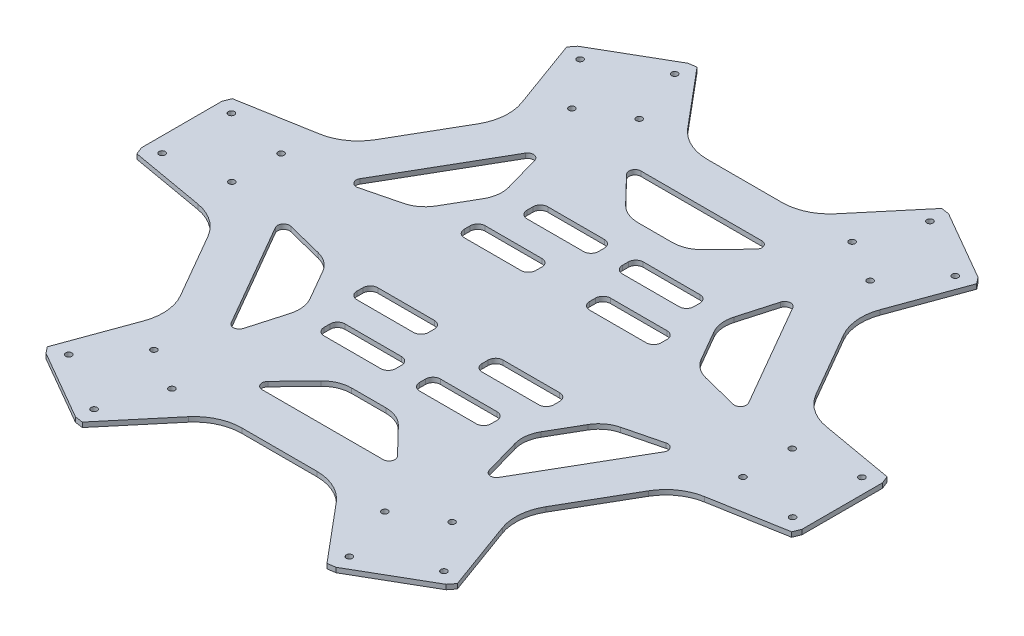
from build123d import *

# Parameters (mm, degrees)
BASE_PLATE_DEPTH                  = 1.6
FILLET3_R                         = 16
M2_5X0_45_TAPPED_HOLE1_AT_2_COUNT = 2
M2_5X0_45_TAPPED_HOLE1_AT_2_PITCH = 20.278621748
M2_5X0_45_TAPPED_HOLE1_AT_3_COUNT = 2
M2_5X0_45_TAPPED_HOLE1_AT_3_PITCH = 28.178404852
M2_5X0_45_TAPPED_HOLE1_AT_4_COUNT = 2
M2_5X0_45_TAPPED_HOLE1_AT_4_PITCH = 23.2
CIRPATTERN1_COUNT                 = 6
CUT_EXTRUDE1_REACH                = 153.283
FILLET4_R                         = 2
FILLET5_R                         = 10
CIRPATTERN2_COUNT                 = 6
FILLET4_OF_CIRPATTERN2_R          = 2
FILLET5_OF_CIRPATTERN2_R          = 10
CUT_EXTRUDE2_REACH                = 153.283
SKETCH8_W                         = 24
SKETCH8_H                         = 7
FILLET6_R                         = 2.5


with BuildPart() as part:
    # Sketch2 → Base plate (new body)
    with BuildSketch(Plane(origin=(0, 0, 0), x_dir=(1, 0, 0), z_dir=(0, 1, 0))):
        Polygon((-67.549981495, -39), (-77.558311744, -21.665063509), (-109.75, -16), (-110.75, -13.5), (-110.75, 13.5), (-109.75, 16), (-77.558311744, 21.665063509), (-67.549981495, 39), (-57.541651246, 56.334936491), (-68.731406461, 87.046288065), (-67.066342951, 89.162313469), (-43.683657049, 102.662313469), (-41.018593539, 103.046288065), (-20.016660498, 78), (0, 78), (20.016660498, 78), (41.018593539, 103.046288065), (43.683657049, 102.662313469), (67.066342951, 89.162313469), (68.731406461, 87.046288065), (57.541651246, 56.334936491), (67.549981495, 39), (77.558311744, 21.665063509), (109.75, 16), (110.75, 13.5), (110.75, -13.5), (109.75, -16), (77.558311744, -21.665063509), (67.549981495, -39), (57.541651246, -56.334936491), (68.731406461, -87.046288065), (67.066342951, -89.162313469), (43.683657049, -102.662313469), (41.018593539, -103.046288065), (20.016660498, -78), (0, -78), (-20.016660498, -78), (-41.018593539, -103.046288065), (-43.683657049, -102.662313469), (-67.066342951, -89.162313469), (-68.731406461, -87.046288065), (-57.541651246, -56.334936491), align=None)
    extrude(amount=BASE_PLATE_DEPTH)

    # Fillet3
    fillet3_edges = [part.edges().sort_by_distance(p)[0] for p in [
        (-77.558311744, 0.8, 21.665063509),
        (-77.558311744, 0.8, -21.665063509),
        (-57.541651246, 0.8, -56.334936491),
        (-20.016660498, 0.8, -78),
        (20.016660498, 0.8, -78),
        (57.541651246, 0.8, -56.334936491),
        (77.558311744, 0.8, -21.665063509),
        (77.558311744, 0.8, 21.665063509),
        (57.541651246, 0.8, 56.334936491),
        (20.016660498, 0.8, 78),
        (-20.016660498, 0.8, 78),
        (-57.541651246, 0.8, 56.334936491),
    ]]
    fillet(fillet3_edges, radius=FILLET3_R)

    # Sketch5 → M2.5x0.45 Tapped Hole1 (revolve, cut)
    with BuildSketch(Plane(origin=(-62.885894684, 1.6, -85.721564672), x_dir=(0, 0, 1), z_dir=(1, 0, 0))):
        Polygon((0, 0), (0, 6.965882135), (1.025, 6.35), (1.025, 0), align=None)
    m2_5x0_45_tapped_hole1 = revolve(axis=Axis((-62.885894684, 7.95, -85.721564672), (0, -1, 0)), mode=Mode.SUBTRACT)

    # M2.5x0.45 Tapped Hole1 at 2: M2.5x0.45 Tapped Hole1 ×2
    with Locations(*[Vector(0.6361963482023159, 0, 0.7715271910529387) * (i * M2_5X0_45_TAPPED_HOLE1_AT_2_PITCH) for i in range(1, M2_5X0_45_TAPPED_HOLE1_AT_2_COUNT)]):
        add(m2_5x0_45_tapped_hole1, mode=Mode.SUBTRACT)

    # M2.5x0.45 Tapped Hole1 at 3: M2.5x0.45 Tapped Hole1 ×2
    with Locations(*[Vector(0.9649447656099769, 0, 0.262453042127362) * (i * M2_5X0_45_TAPPED_HOLE1_AT_3_PITCH) for i in range(1, M2_5X0_45_TAPPED_HOLE1_AT_3_COUNT)]):
        add(m2_5x0_45_tapped_hole1, mode=Mode.SUBTRACT)

    # M2.5x0.45 Tapped Hole1 at 4: M2.5x0.45 Tapped Hole1 ×2
    with Locations(*[Vector(0.8660254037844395, 0, -0.4999999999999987) * (i * M2_5X0_45_TAPPED_HOLE1_AT_4_PITCH) for i in range(1, M2_5X0_45_TAPPED_HOLE1_AT_4_COUNT)]):
        add(m2_5x0_45_tapped_hole1, mode=Mode.SUBTRACT)

    # CirPattern1: M2.5x0.45 Tapped Hole1 ×6 about axis
    cirpattern1_axis = Axis((0, 0, 0), (0, 1, 0))
    for i in range(1, CIRPATTERN1_COUNT):
        add(m2_5x0_45_tapped_hole1.rotate(cirpattern1_axis, i * 360 / CIRPATTERN1_COUNT), mode=Mode.SUBTRACT)

    # CirPattern1 copy 1 sketch → CirPattern1 copy 1 (revolve, cut)
    with BuildSketch(Plane(origin=(-85.68, 1.6, 8.25), x_dir=(0.8660254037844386, 0, 0.5000000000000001), z_dir=(0.5000000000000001, 0, -0.8660254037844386))):
        Polygon((0, 0), (0, 6.965882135), (1.025, 6.35), (1.025, 0), align=None)
    revolve(axis=Axis((-85.68, 7.95, 8.25), (0, -1, 0)), mode=Mode.SUBTRACT)

    # CirPattern1 copy 2 sketch → CirPattern1 copy 2 (revolve, cut)
    with BuildSketch(Plane(origin=(-35.695290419, 1.6, 78.326056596), x_dir=(0.8660254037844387, 0, -0.4999999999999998), z_dir=(-0.4999999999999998, 0, -0.8660254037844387))):
        Polygon((0, 0), (0, 6.965882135), (1.025, 6.35), (1.025, 0), align=None)
    revolve(axis=Axis((-35.695290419, 7.95, 78.326056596), (0, -1, 0)), mode=Mode.SUBTRACT)

    # CirPattern1 copy 3 sketch → CirPattern1 copy 3 (revolve, cut)
    with BuildSketch(Plane(origin=(49.984709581, 1.6, 70.076056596), x_dir=(0, 0, -1), z_dir=(-1, 0, 0))):
        Polygon((0, 0), (0, 6.965882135), (1.025, 6.35), (1.025, 0), align=None)
    revolve(axis=Axis((49.984709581, 7.95, 70.076056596), (0, -1, 0)), mode=Mode.SUBTRACT)

    # CirPattern1 copy 4 sketch → CirPattern1 copy 4 (revolve, cut)
    with BuildSketch(Plane(origin=(85.68, 1.6, -8.25), x_dir=(-0.8660254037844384, 0, -0.5000000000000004), z_dir=(-0.5000000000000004, 0, 0.8660254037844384))):
        Polygon((0, 0), (0, 6.965882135), (1.025, 6.35), (1.025, 0), align=None)
    revolve(axis=Axis((85.68, 7.95, -8.25), (0, -1, 0)), mode=Mode.SUBTRACT)

    # CirPattern1 copy 5 sketch → CirPattern1 copy 5 (revolve, cut)
    with BuildSketch(Plane(origin=(35.695290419, 1.6, -78.326056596), x_dir=(-0.8660254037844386, 0, 0.5000000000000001), z_dir=(0.5000000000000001, 0, 0.8660254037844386))):
        Polygon((0, 0), (0, 6.965882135), (1.025, 6.35), (1.025, 0), align=None)
    revolve(axis=Axis((35.695290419, 7.95, -78.326056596), (0, -1, 0)), mode=Mode.SUBTRACT)

    # CirPattern1 copy 6 sketch → CirPattern1 copy 6 (revolve, cut)
    with BuildSketch(Plane(origin=(-85.68, 1.6, -8.25), x_dir=(0.8660254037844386, 0, 0.5000000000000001), z_dir=(0.5000000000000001, 0, -0.8660254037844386))):
        Polygon((0, 0), (0, 6.965882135), (1.025, 6.35), (1.025, 0), align=None)
    revolve(axis=Axis((-85.68, 7.95, -8.25), (0, -1, 0)), mode=Mode.SUBTRACT)

    # CirPattern1 copy 7 sketch → CirPattern1 copy 7 (revolve, cut)
    with BuildSketch(Plane(origin=(-49.984709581, 1.6, 70.076056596), x_dir=(0.8660254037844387, 0, -0.4999999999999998), z_dir=(-0.4999999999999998, 0, -0.8660254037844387))):
        Polygon((0, 0), (0, 6.965882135), (1.025, 6.35), (1.025, 0), align=None)
    revolve(axis=Axis((-49.984709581, 7.95, 70.076056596), (0, -1, 0)), mode=Mode.SUBTRACT)

    # CirPattern1 copy 8 sketch → CirPattern1 copy 8 (revolve, cut)
    with BuildSketch(Plane(origin=(35.695290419, 1.6, 78.326056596), x_dir=(0, 0, -1), z_dir=(-1, 0, 0))):
        Polygon((0, 0), (0, 6.965882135), (1.025, 6.35), (1.025, 0), align=None)
    revolve(axis=Axis((35.695290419, 7.95, 78.326056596), (0, -1, 0)), mode=Mode.SUBTRACT)

    # CirPattern1 copy 9 sketch → CirPattern1 copy 9 (revolve, cut)
    with BuildSketch(Plane(origin=(85.68, 1.6, 8.25), x_dir=(-0.8660254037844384, 0, -0.5000000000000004), z_dir=(-0.5000000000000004, 0, 0.8660254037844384))):
        Polygon((0, 0), (0, 6.965882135), (1.025, 6.35), (1.025, 0), align=None)
    revolve(axis=Axis((85.68, 7.95, 8.25), (0, -1, 0)), mode=Mode.SUBTRACT)

    # CirPattern1 copy 10 sketch → CirPattern1 copy 10 (revolve, cut)
    with BuildSketch(Plane(origin=(49.984709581, 1.6, -70.076056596), x_dir=(-0.8660254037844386, 0, 0.5000000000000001), z_dir=(0.5000000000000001, 0, 0.8660254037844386))):
        Polygon((0, 0), (0, 6.965882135), (1.025, 6.35), (1.025, 0), align=None)
    revolve(axis=Axis((49.984709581, 7.95, -70.076056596), (0, -1, 0)), mode=Mode.SUBTRACT)

    # CirPattern1 copy 11 sketch → CirPattern1 copy 11 (revolve, cut)
    with BuildSketch(Plane(origin=(-105.68, 1.6, -11.6), x_dir=(0.8660254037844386, 0, 0.5000000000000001), z_dir=(0.5000000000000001, 0, -0.8660254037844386))):
        Polygon((0, 0), (0, 6.965882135), (1.025, 6.35), (1.025, 0), align=None)
    revolve(axis=Axis((-105.68, 7.95, -11.6), (0, -1, 0)), mode=Mode.SUBTRACT)

    # CirPattern1 copy 12 sketch → CirPattern1 copy 12 (revolve, cut)
    with BuildSketch(Plane(origin=(-62.885894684, 1.6, 85.721564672), x_dir=(0.8660254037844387, 0, -0.4999999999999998), z_dir=(-0.4999999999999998, 0, -0.8660254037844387))):
        Polygon((0, 0), (0, 6.965882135), (1.025, 6.35), (1.025, 0), align=None)
    revolve(axis=Axis((-62.885894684, 7.95, 85.721564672), (0, -1, 0)), mode=Mode.SUBTRACT)

    # CirPattern1 copy 13 sketch → CirPattern1 copy 13 (revolve, cut)
    with BuildSketch(Plane(origin=(42.794105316, 1.6, 97.321564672), x_dir=(0, 0, -1), z_dir=(-1, 0, 0))):
        Polygon((0, 0), (0, 6.965882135), (1.025, 6.35), (1.025, 0), align=None)
    revolve(axis=Axis((42.794105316, 7.95, 97.321564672), (0, -1, 0)), mode=Mode.SUBTRACT)

    # CirPattern1 copy 14 sketch → CirPattern1 copy 14 (revolve, cut)
    with BuildSketch(Plane(origin=(105.68, 1.6, 11.6), x_dir=(-0.8660254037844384, 0, -0.5000000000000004), z_dir=(-0.5000000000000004, 0, 0.8660254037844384))):
        Polygon((0, 0), (0, 6.965882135), (1.025, 6.35), (1.025, 0), align=None)
    revolve(axis=Axis((105.68, 7.95, 11.6), (0, -1, 0)), mode=Mode.SUBTRACT)

    # CirPattern1 copy 15 sketch → CirPattern1 copy 15 (revolve, cut)
    with BuildSketch(Plane(origin=(62.885894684, 1.6, -85.721564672), x_dir=(-0.8660254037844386, 0, 0.5000000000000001), z_dir=(0.5000000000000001, 0, 0.8660254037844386))):
        Polygon((0, 0), (0, 6.965882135), (1.025, 6.35), (1.025, 0), align=None)
    revolve(axis=Axis((62.885894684, 7.95, -85.721564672), (0, -1, 0)), mode=Mode.SUBTRACT)

    # Sketch7 → Cut-Extrude1 (cut, up to next)
    with BuildSketch(Plane(origin=(0, 1.6, 0), x_dir=(1, 0, 0), z_dir=(0, 1, 0)), mode=Mode.PRIVATE) as cut_extrude1_sk1:
        Polygon((25, 63.5), (-25, 63.5), (-10, 48), (10, 48), align=None)
    cut_extrude1_tool1 = extrude(cut_extrude1_sk1.sketch, amount=-CUT_EXTRUDE1_REACH, mode=Mode.PRIVATE) & part.part
    cut_extrude1 = cut_extrude1_tool1.solids().sort_by_distance((0, 1.6, -56.857143))[0]
    add(cut_extrude1, mode=Mode.SUBTRACT)

    # Fillet4
    fillet4_edges = [part.edges().sort_by_distance(p)[0] for p in [
        (25, 0.8, -63.5),
        (-25, 0.8, -63.5),
    ]]
    fillet(fillet4_edges, radius=FILLET4_R)

    # Fillet5
    fillet5_edges = [part.edges().sort_by_distance(p)[0] for p in [
        (10, 0.8, -48),
        (-10, 0.8, -48),
    ]]
    fillet(fillet5_edges, radius=FILLET5_R)

    # CirPattern2: Cut-Extrude1 ×6 about axis
    cirpattern2_axis = Axis((0, 0, 0), (0, 1, 0))
    for i in range(1, CIRPATTERN2_COUNT):
        add(cut_extrude1.rotate(cirpattern2_axis, i * 360 / CIRPATTERN2_COUNT), mode=Mode.SUBTRACT)

    # Fillet4 of CirPattern2
    fillet4_of_cirpattern2_edges = [part.edges().sort_by_distance(p)[0] for p in [
        (-42.49261314, 0.8, -53.400635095),
        (-67.49261314, 0.8, -10.099364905),
        (-67.49261314, 0.8, 10.099364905),
        (-42.49261314, 0.8, 53.400635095),
        (-25, 0.8, 63.5),
        (25, 0.8, 63.5),
        (42.49261314, 0.8, 53.400635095),
        (67.49261314, 0.8, 10.099364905),
        (67.49261314, 0.8, -10.099364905),
        (42.49261314, 0.8, -53.400635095),
    ]]
    fillet(fillet4_of_cirpattern2_edges, radius=FILLET4_OF_CIRPATTERN2_R)

    # Fillet5 of CirPattern2
    fillet5_of_cirpattern2_edges = [part.edges().sort_by_distance(p)[0] for p in [
        (-36.569219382, 0.8, -32.660254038),
        (-46.569219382, 0.8, -15.339745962),
        (-46.569219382, 0.8, 15.339745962),
        (-36.569219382, 0.8, 32.660254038),
        (-10, 0.8, 48),
        (10, 0.8, 48),
        (36.569219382, 0.8, 32.660254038),
        (46.569219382, 0.8, 15.339745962),
        (46.569219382, 0.8, -15.339745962),
        (36.569219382, 0.8, -32.660254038),
    ]]
    fillet(fillet5_of_cirpattern2_edges, radius=FILLET5_OF_CIRPATTERN2_R)

    # Sketch8 → Cut-Extrude2 (cut, up to next)
    with BuildSketch(Plane(origin=(0, 1.6, 0), x_dir=(1, 0, 0), z_dir=(0, 1, 0)), mode=Mode.PRIVATE) as cut_extrude2_sk1:
        with Locations((-16, 34)):
            Rectangle(SKETCH8_W, SKETCH8_H)
    cut_extrude2_tool1 = extrude(cut_extrude2_sk1.sketch, amount=-CUT_EXTRUDE2_REACH, mode=Mode.PRIVATE) & part.part
    # Sketch8 → Cut-Extrude2 (cut, up to next)
    with BuildSketch(Plane(origin=(0, 1.6, 0), x_dir=(1, 0, 0), z_dir=(0, 1, 0)), mode=Mode.PRIVATE) as cut_extrude2_sk2:
        with Locations((-21, 18)):
            Rectangle(SKETCH8_W, SKETCH8_H)
    cut_extrude2_tool2 = extrude(cut_extrude2_sk2.sketch, amount=-CUT_EXTRUDE2_REACH, mode=Mode.PRIVATE) & part.part
    # Sketch8 → Cut-Extrude2 (cut, up to next)
    with BuildSketch(Plane(origin=(0, 1.6, 0), x_dir=(1, 0, 0), z_dir=(0, 1, 0)), mode=Mode.PRIVATE) as cut_extrude2_sk3:
        with Locations((16, 34)):
            Rectangle(SKETCH8_W, SKETCH8_H)
    cut_extrude2_tool3 = extrude(cut_extrude2_sk3.sketch, amount=-CUT_EXTRUDE2_REACH, mode=Mode.PRIVATE) & part.part
    # Sketch8 → Cut-Extrude2 (cut, up to next)
    with BuildSketch(Plane(origin=(0, 1.6, 0), x_dir=(1, 0, 0), z_dir=(0, 1, 0)), mode=Mode.PRIVATE) as cut_extrude2_sk4:
        with Locations((21, 18)):
            Rectangle(SKETCH8_W, SKETCH8_H)
    cut_extrude2_tool4 = extrude(cut_extrude2_sk4.sketch, amount=-CUT_EXTRUDE2_REACH, mode=Mode.PRIVATE) & part.part
    # Sketch8 → Cut-Extrude2 (cut, up to next)
    with BuildSketch(Plane(origin=(0, 1.6, 0), x_dir=(1, 0, 0), z_dir=(0, 1, 0)), mode=Mode.PRIVATE) as cut_extrude2_sk5:
        with Locations((21, -18)):
            Rectangle(SKETCH8_W, SKETCH8_H)
    cut_extrude2_tool5 = extrude(cut_extrude2_sk5.sketch, amount=-CUT_EXTRUDE2_REACH, mode=Mode.PRIVATE) & part.part
    # Sketch8 → Cut-Extrude2 (cut, up to next)
    with BuildSketch(Plane(origin=(0, 1.6, 0), x_dir=(1, 0, 0), z_dir=(0, 1, 0)), mode=Mode.PRIVATE) as cut_extrude2_sk6:
        with Locations((16, -34)):
            Rectangle(SKETCH8_W, SKETCH8_H)
    cut_extrude2_tool6 = extrude(cut_extrude2_sk6.sketch, amount=-CUT_EXTRUDE2_REACH, mode=Mode.PRIVATE) & part.part
    # Sketch8 → Cut-Extrude2 (cut, up to next)
    with BuildSketch(Plane(origin=(0, 1.6, 0), x_dir=(1, 0, 0), z_dir=(0, 1, 0)), mode=Mode.PRIVATE) as cut_extrude2_sk7:
        with Locations((-21, -18)):
            Rectangle(SKETCH8_W, SKETCH8_H)
    cut_extrude2_tool7 = extrude(cut_extrude2_sk7.sketch, amount=-CUT_EXTRUDE2_REACH, mode=Mode.PRIVATE) & part.part
    # Sketch8 → Cut-Extrude2 (cut, up to next)
    with BuildSketch(Plane(origin=(0, 1.6, 0), x_dir=(1, 0, 0), z_dir=(0, 1, 0)), mode=Mode.PRIVATE) as cut_extrude2_sk8:
        with Locations((-16, -34)):
            Rectangle(SKETCH8_W, SKETCH8_H)
    cut_extrude2_tool8 = extrude(cut_extrude2_sk8.sketch, amount=-CUT_EXTRUDE2_REACH, mode=Mode.PRIVATE) & part.part
    add(cut_extrude2_tool1.solids().sort_by_distance((-16, 1.6, -34))[0], mode=Mode.SUBTRACT)
    add(cut_extrude2_tool2.solids().sort_by_distance((-21, 1.6, -18))[0], mode=Mode.SUBTRACT)
    add(cut_extrude2_tool3.solids().sort_by_distance((16, 1.6, -34))[0], mode=Mode.SUBTRACT)
    add(cut_extrude2_tool4.solids().sort_by_distance((21, 1.6, -18))[0], mode=Mode.SUBTRACT)
    add(cut_extrude2_tool5.solids().sort_by_distance((21, 1.6, 18))[0], mode=Mode.SUBTRACT)
    add(cut_extrude2_tool6.solids().sort_by_distance((16, 1.6, 34))[0], mode=Mode.SUBTRACT)
    add(cut_extrude2_tool7.solids().sort_by_distance((-21, 1.6, 18))[0], mode=Mode.SUBTRACT)
    add(cut_extrude2_tool8.solids().sort_by_distance((-16, 1.6, 34))[0], mode=Mode.SUBTRACT)

    # Fillet6
    fillet6_edges = [part.edges().sort_by_distance(p)[0] for p in [
        (28, 0.8, 37.5),
        (4, 0.8, 37.5),
        (4, 0.8, 30.5),
        (28, 0.8, 30.5),
        (28, 0.8, -37.5),
        (28, 0.8, -30.5),
        (4, 0.8, -30.5),
        (4, 0.8, -37.5),
        (33, 0.8, -21.5),
        (33, 0.8, -14.5),
        (9, 0.8, -14.5),
        (9, 0.8, -21.5),
        (-9, 0.8, -21.5),
        (-9, 0.8, -14.5),
        (-33, 0.8, -14.5),
        (-33, 0.8, -21.5),
        (9, 0.8, 14.5),
        (33, 0.8, 14.5),
        (33, 0.8, 21.5),
        (9, 0.8, 21.5),
        (-33, 0.8, 21.5),
        (-33, 0.8, 14.5),
        (-9, 0.8, 14.5),
        (-9, 0.8, 21.5),
        (-28, 0.8, 37.5),
        (-28, 0.8, 30.5),
        (-4, 0.8, 30.5),
        (-4, 0.8, 37.5),
        (-4, 0.8, -37.5),
        (-4, 0.8, -30.5),
        (-28, 0.8, -30.5),
        (-28, 0.8, -37.5),
    ]]
    fillet(fillet6_edges, radius=FILLET6_R)


solid = part.part
